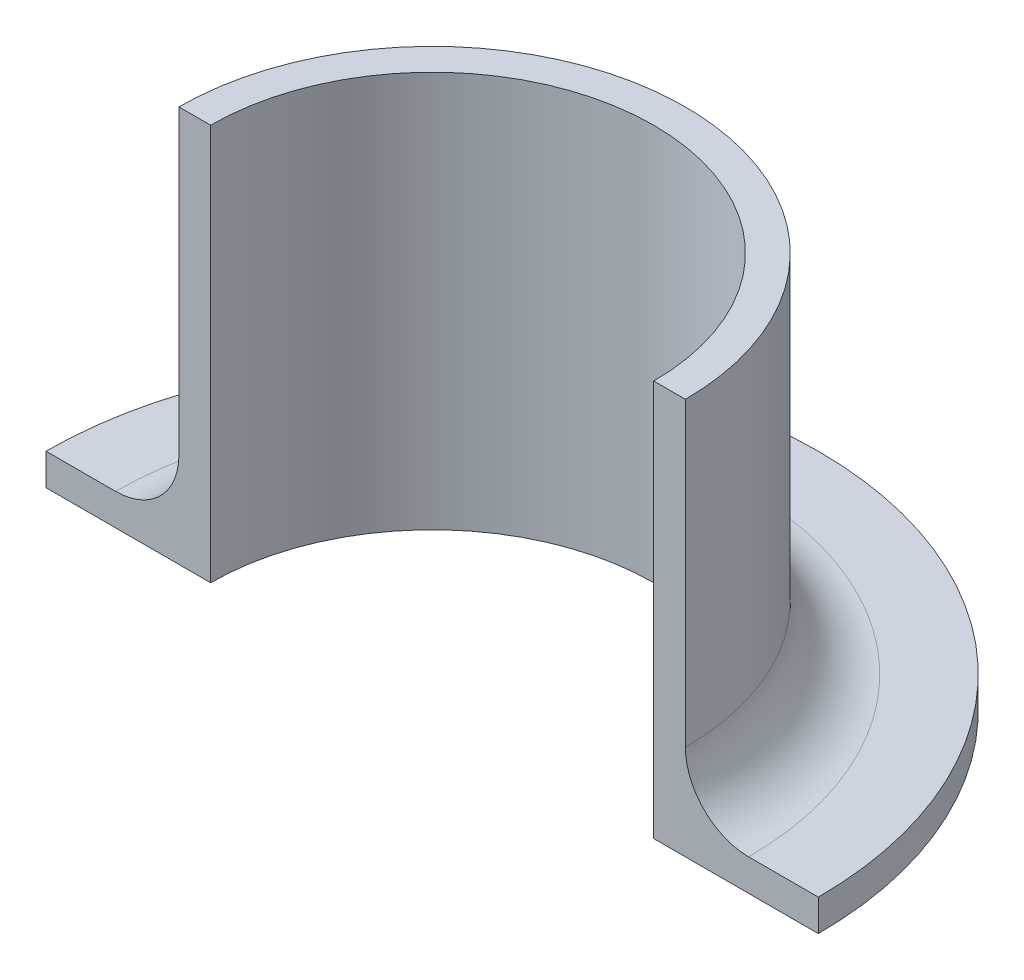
from build123d import *

# Parameters (mm, degrees)
REVOLVE1_ANGLE = 180


with BuildPart() as part:
    # Sketch1 → Revolve1 (revolve)
    with BuildSketch(Plane.XY):
        with BuildLine():
            Line((-22.225, 17.189373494), (-22.225, -22.561626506))
            Line((-22.225, -22.561626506), (-38.735, -22.561626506))
            Line((-38.735, -22.561626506), (-38.735, -19.386626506))
            Line((-38.735, -19.386626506), (-31.75, -19.386626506))
            ThreePointArc((-31.75, -19.386626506), (-27.259871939, -17.526754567), (-25.4, -13.036626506))
            Line((-25.4, -13.036626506), (-25.4, 17.189373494))
            Line((-25.4, 17.189373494), (-22.225, 17.189373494))
        make_face()
    revolve(axis=Axis((0, 41.915791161, 0), (0, -1, 0)), revolution_arc=REVOLVE1_ANGLE)


solid = part.part
